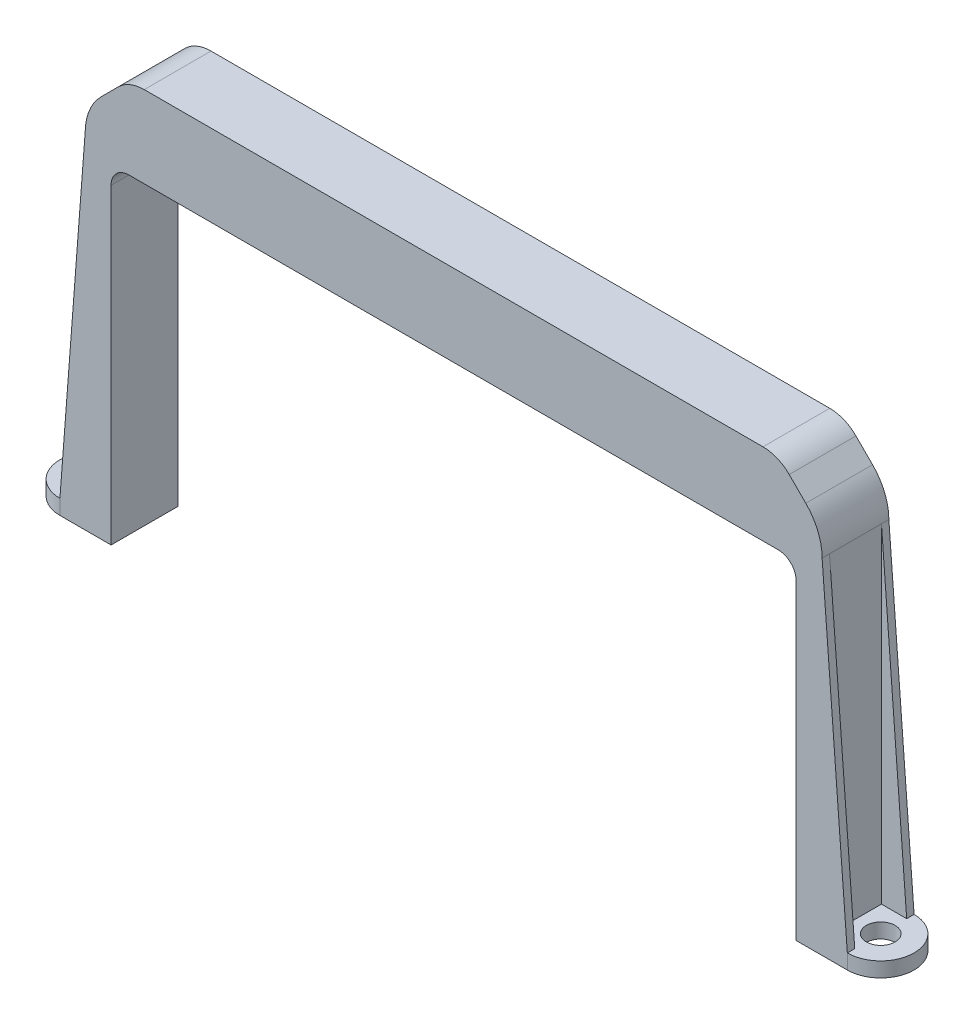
from build123d import *

# Parameters (mm, degrees)
SKETCH1_W           = 111.2012
SKETCH1_H           = 3.81
BOSS_EXTRUDE1_DEPTH = 11.43
BOSS_EXTRUDE2_DEPTH = 11.43
LPATTERN1_COUNT     = 6
LPATTERN1_PITCH     = 20.32
SKETCH3_W           = 111.2012
SKETCH3_H           = 10.16
BOSS_EXTRUDE3_DEPTH = 2.54
BOSS_EXTRUDE4_DEPTH = 11.43
SKETCH5_R           = 2.4638
BOSS_EXTRUDE5_DEPTH = 2.54
BOSS_EXTRUDE6_DEPTH = 1.27
BOSS_EXTRUDE7_DEPTH = 1.27
FILLET1_R           = 6.35


with BuildPart() as part:
    # Sketch1 → Boss-Extrude1 (new body)
    with BuildSketch(Plane.XY):
        with Locations((0, 1.905)):
            Rectangle(SKETCH1_W, SKETCH1_H)
    extrude(amount=BOSS_EXTRUDE1_DEPTH)

    # Sketch2 → Boss-Extrude2 (add)
    with BuildSketch(Plane(origin=(0, 0, 0), x_dir=(-1, 0, 0), z_dir=(0, 0, -1))):
        Polygon((-55.6006, 0), (-51.7906, 0), (-51.7906, -6.985), (-52.641338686, -10.16), (-55.6006, -10.16), align=None)
        Polygon((-49.8094, 0), (-49.8094, -6.985), (-48.958661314, -10.16), (-45.9994, -10.16), (-45.9994, 0), align=None)
    boss_extrude2 = extrude(amount=-BOSS_EXTRUDE2_DEPTH)

    # LPattern1: Boss-Extrude2 ×6
    with Locations(*[(-i * LPATTERN1_PITCH, 0, 0) for i in range(1, LPATTERN1_COUNT)]):
        add(boss_extrude2)

    # Sketch3 → Boss-Extrude3 (add)
    with BuildSketch(Plane.XY.offset(11.43)):
        with Locations((0, -5.08)):
            Rectangle(SKETCH3_W, SKETCH3_H)
    extrude(amount=-BOSS_EXTRUDE3_DEPTH)

    # Sketch4 → Boss-Extrude4 (add)
    with BuildSketch(Plane.XY.offset(11.43)):
        with BuildLine():
            Line((58.6486, -13.208), (58.6486, -66.55944))
            Line((58.6486, -66.55944), (63.0936, -66.55944))
            Line((63.0936, -66.55944), (63.0936, -7.628384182))
            ThreePointArc((63.0936, -7.628384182), (62.368552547, -3.983324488), (60.303792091, -0.893192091))
            Line((60.303792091, -0.893192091), (55.6006, 3.81))
            Line((55.6006, 3.81), (55.6006, -10.16))
            ThreePointArc((55.6006, -10.16), (57.755861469, -11.052738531), (58.6486, -13.208))
        make_face()
    boss_extrude4 = extrude(amount=-BOSS_EXTRUDE4_DEPTH)

    # Sketch5 → Boss-Extrude5 (add)
    with BuildSketch(Plane.XZ.offset(66.55944)):
        with BuildLine():
            Line((63.0936, 0), (67.4116, 0))
            ThreePointArc((67.4116, 0), (73.1266, 5.715), (67.4116, 11.43))
            Line((67.4116, 11.43), (63.0936, 11.43))
            Line((63.0936, 11.43), (63.0936, 0))
        make_face()
        with Locations(Location((67.4116, 5.715, 0), (0, 0, 270))):
            Circle(SKETCH5_R, mode=Mode.SUBTRACT)
    boss_extrude5 = extrude(amount=-BOSS_EXTRUDE5_DEPTH)

    # Sketch6 → Boss-Extrude6 (add)
    with BuildSketch(Plane(origin=(0, 0, 0), x_dir=(-1, 0, 0), z_dir=(0, 0, -1))):
        Polygon((-63.0936, -7.628384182), (-67.4116, -64.01944), (-63.0936, -64.01944), align=None)
    boss_extrude6 = extrude(amount=-BOSS_EXTRUDE6_DEPTH)

    # Sketch7 → Boss-Extrude7 (add)
    with BuildSketch(Plane.XY.offset(11.43)):
        Polygon((63.0936, -7.628384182), (63.0936, -64.01944), (67.4116, -64.01944), align=None)
    boss_extrude7 = extrude(amount=-BOSS_EXTRUDE7_DEPTH)

    # Mirror1: Boss-Extrude4, Boss-Extrude5, Boss-Extrude6, Boss-Extrude7 across plane
    add(boss_extrude4.mirror(Plane(origin=(0, 0, 0), x_dir=(0, 0, 1), z_dir=(1, 0, 0))))
    add(boss_extrude5.mirror(Plane(origin=(0, 0, 0), x_dir=(0, 0, 1), z_dir=(1, 0, 0))))
    add(boss_extrude6.mirror(Plane(origin=(0, 0, 0), x_dir=(0, 0, 1), z_dir=(1, 0, 0))))
    add(boss_extrude7.mirror(Plane(origin=(0, 0, 0), x_dir=(0, 0, 1), z_dir=(1, 0, 0))))

    # Fillet1
    fillet1_edges = [part.edges().sort_by_distance(p)[0] for p in [
        (-55.6006, 3.81, 5.715),
        (55.6006, 3.81, 5.715),
    ]]
    fillet(fillet1_edges, radius=FILLET1_R)


solid = part.part
